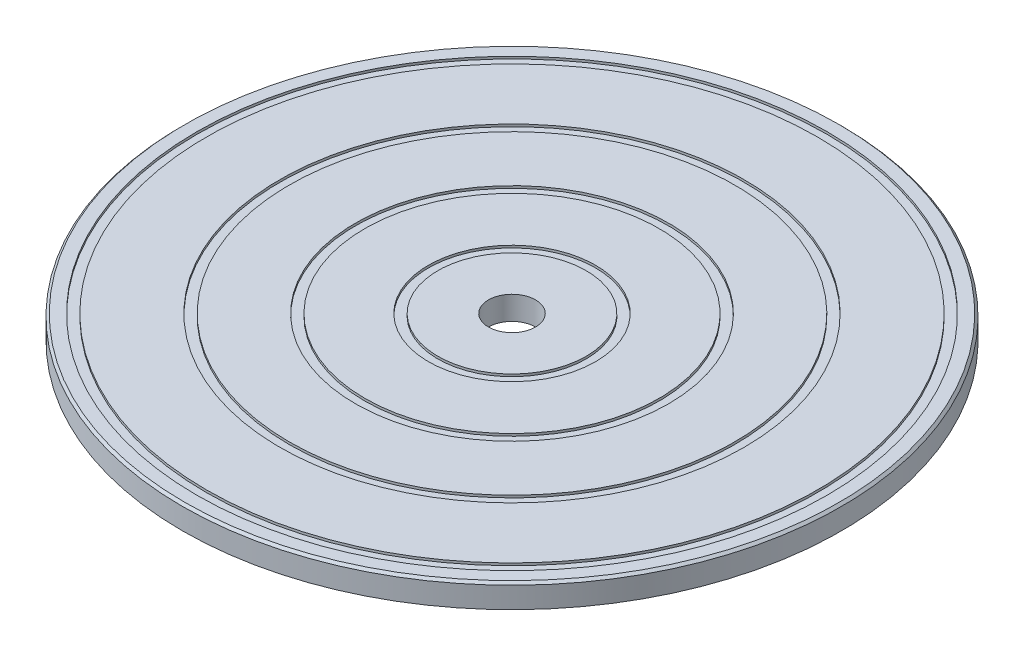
from build123d import *

# Parameters (mm, degrees)
SKETCH1_R               = 70
SKETCH1_R_2             = 5
BOSS_EXTRUDE1_DEPTH     = 5
SKETCH2_R               = 17.75691651
SKETCH2_R_2             = 15.75691651
CUT_EXTRUDE_THIN1_DEPTH = 0.5
SKETCH3_R               = 33.254840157
SKETCH3_R_2             = 31.254840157
CUT_EXTRUDE_THIN2_DEPTH = 0.5
SKETCH4_R               = 49.28626849
SKETCH4_R_2             = 47.28626849
CUT_EXTRUDE_THIN3_DEPTH = 0.5
SKETCH5_R               = 66.911531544
SKETCH5_R_2             = 64.911531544
CUT_EXTRUDE_THIN4_DEPTH = 0.5
CHAMFER1_SIZE           = 0.5


with BuildPart() as part:
    # Sketch1 → Boss-Extrude1 (new body)
    with BuildSketch(Plane(origin=(0, 0, 0), x_dir=(1, 0, 0), z_dir=(0, 1, 0))):
        with Locations(Location((0, 0, 0), (0, 0, 270))):
            Circle(SKETCH1_R)
        with Locations(Location((0, 0, 0), (0, 0, 270))):
            Circle(SKETCH1_R_2, mode=Mode.SUBTRACT)
    extrude(amount=BOSS_EXTRUDE1_DEPTH)

    # Sketch2 → Cut-Extrude-Thin1 (cut)
    with BuildSketch(Plane(origin=(0, 5, 0), x_dir=(1, 0, 0), z_dir=(0, 1, 0))):
        Circle(SKETCH2_R)
        Circle(SKETCH2_R_2, mode=Mode.SUBTRACT)
    extrude(amount=-CUT_EXTRUDE_THIN1_DEPTH, mode=Mode.SUBTRACT)

    # Sketch3 → Cut-Extrude-Thin2 (cut)
    with BuildSketch(Plane(origin=(0, 5, 0), x_dir=(1, 0, 0), z_dir=(0, 1, 0))):
        Circle(SKETCH3_R)
        Circle(SKETCH3_R_2, mode=Mode.SUBTRACT)
    extrude(amount=-CUT_EXTRUDE_THIN2_DEPTH, mode=Mode.SUBTRACT)

    # Sketch4 → Cut-Extrude-Thin3 (cut)
    with BuildSketch(Plane(origin=(0, 5, 0), x_dir=(1, 0, 0), z_dir=(0, 1, 0))):
        Circle(SKETCH4_R)
        Circle(SKETCH4_R_2, mode=Mode.SUBTRACT)
    extrude(amount=-CUT_EXTRUDE_THIN3_DEPTH, mode=Mode.SUBTRACT)

    # Sketch5 → Cut-Extrude-Thin4 (cut)
    with BuildSketch(Plane(origin=(0, 5, 0), x_dir=(1, 0, 0), z_dir=(0, 1, 0))):
        Circle(SKETCH5_R)
        Circle(SKETCH5_R_2, mode=Mode.SUBTRACT)
    extrude(amount=-CUT_EXTRUDE_THIN4_DEPTH, mode=Mode.SUBTRACT)

    # Chamfer1
    chamfer1_edges = [part.edges().sort_by_distance(p)[0] for p in [
        (0, 5, -70),
    ]]
    chamfer(chamfer1_edges, length=CHAMFER1_SIZE)


solid = part.part
